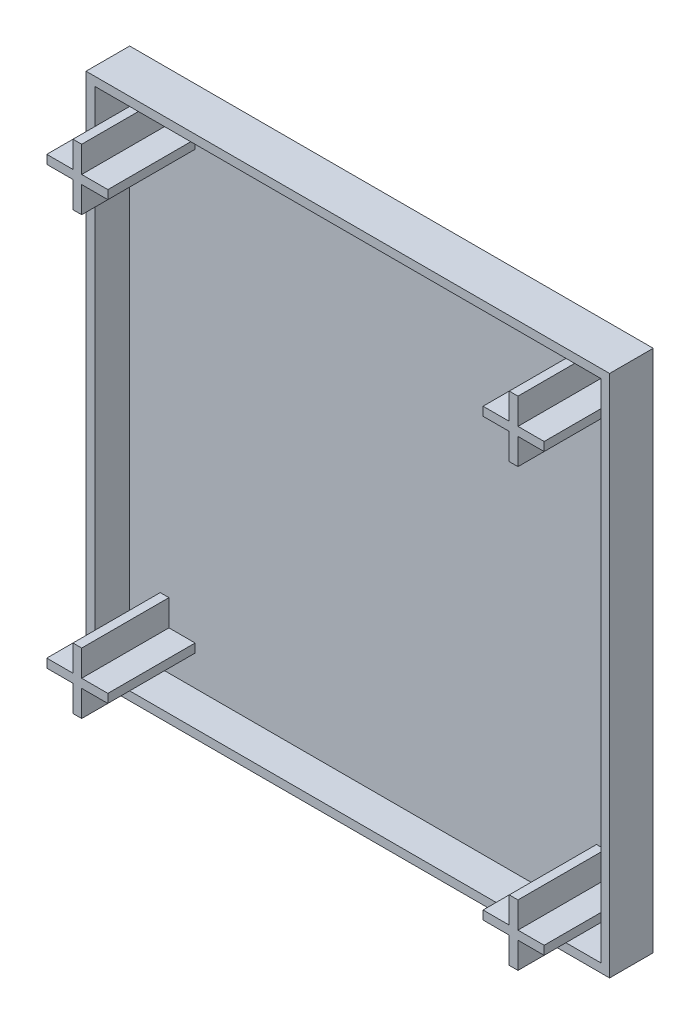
from build123d import *

# Parameters (mm, degrees)
SKETCH_1_W      = 60
SKETCH_1_H      = 60
EXTRUDE_1_DEPTH = 2.5
SHELL_1_T       = -1
EXTRUDE_2_DEPTH = 10


with BuildPart() as part:
    # Sketch 1 → Extrude 1 (new, symmetric)
    with BuildSketch(Plane.XY):
        Rectangle(SKETCH_1_W, SKETCH_1_H)
    extrude(amount=EXTRUDE_1_DEPTH, both=True)

    # Shell 1
    shell_1_openings = [part.faces().sort_by_distance(p)[0] for p in [
        (0, 0, 2.5),
    ]]
    offset(amount=SHELL_1_T, openings=shell_1_openings, kind=Kind.INTERSECTION)

    # Sketch 2 → Extrude 2 (add)
    with BuildSketch(Plane.XY.offset(-1.5)):
        Polygon((-28.5, 25.5), (-25.5, 25.5), (-25.5, 28.5), (-24.5, 28.5), (-24.5, 25.5), (-21.5, 25.5), (-21.5, 24.5), (-24.5, 24.5), (-24.5, 21.5), (-25.5, 21.5), (-25.5, 24.5), (-28.5, 24.5), align=None)
        Polygon((24.5, 25.5), (21.5, 25.5), (21.5, 24.5), (24.5, 24.5), (24.5, 21.5), (25.5, 21.5), (25.5, 24.5), (28.5, 24.5), (28.5, 25.5), (25.5, 25.5), (25.5, 28.5), (24.5, 28.5), align=None)
        Polygon((28.5, -25.5), (25.5, -25.5), (25.5, -28.5), (24.5, -28.5), (24.5, -25.5), (21.5, -25.5), (21.5, -24.5), (24.5, -24.5), (24.5, -21.5), (25.5, -21.5), (25.5, -24.5), (28.5, -24.5), align=None)
        Polygon((-24.5, -28.5), (-24.5, -25.5), (-21.5, -25.5), (-21.5, -24.5), (-24.5, -24.5), (-24.5, -21.5), (-25.5, -21.5), (-25.5, -24.5), (-28.5, -24.5), (-28.5, -25.5), (-25.5, -25.5), (-25.5, -28.5), align=None)
    extrude(amount=EXTRUDE_2_DEPTH)


solid = part.part
